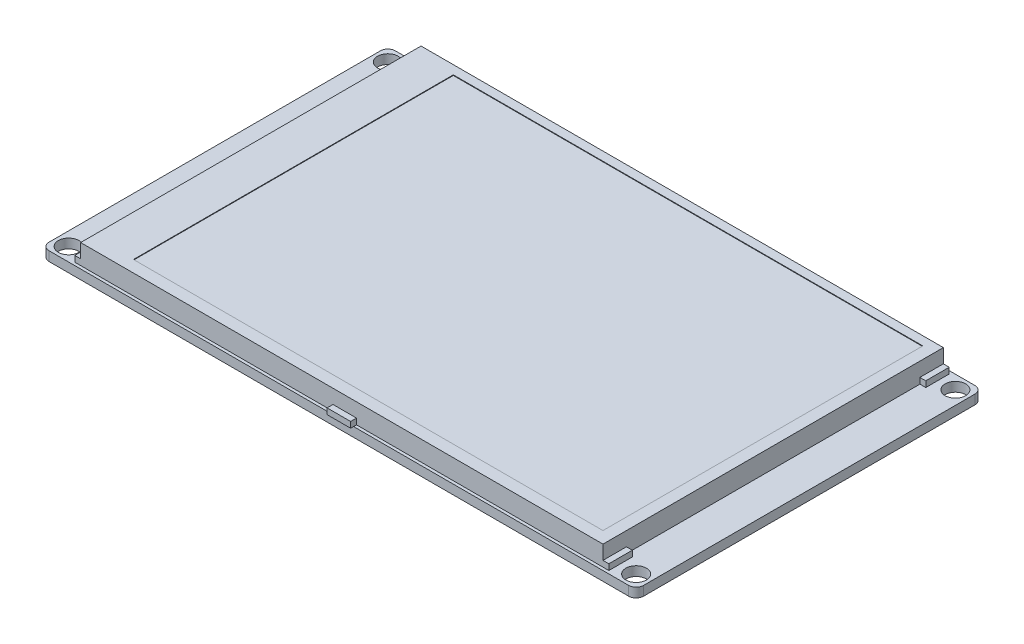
ISO-10303-21;
HEADER;
FILE_DESCRIPTION(('STEP AP214'),'2;1');
FILE_NAME('part.step','',(''),(''),'','','');
FILE_SCHEMA(('AUTOMOTIVE_DESIGN { 1 0 10303 214 1 1 1 1 }'));
ENDSEC;
DATA;
#1=APPLICATION_CONTEXT('core data for automotive mechanical design processes');
#2=APPLICATION_PROTOCOL_DEFINITION('international standard','automotive_design',2000,#1);
#3=PRODUCT_CONTEXT('',#1,'mechanical');
#4=PRODUCT('Part','Part','',(#3));
#5=PRODUCT_RELATED_PRODUCT_CATEGORY('part','',(#4));
#6=PRODUCT_DEFINITION_FORMATION('','',#4);
#7=PRODUCT_DEFINITION_CONTEXT('part definition',#1,'design');
#8=PRODUCT_DEFINITION('design','',#6,#7);
#9=PRODUCT_DEFINITION_SHAPE('','',#8);
#10=(LENGTH_UNIT() NAMED_UNIT(*) SI_UNIT(.MILLI.,.METRE.));
#11=(NAMED_UNIT(*) PLANE_ANGLE_UNIT() SI_UNIT($,.RADIAN.));
#12=(NAMED_UNIT(*) SI_UNIT($,.STERADIAN.) SOLID_ANGLE_UNIT());
#13=UNCERTAINTY_MEASURE_WITH_UNIT(LENGTH_MEASURE(1.E-05),#10,'distance_accuracy_value','');
#14=(GEOMETRIC_REPRESENTATION_CONTEXT(3) GLOBAL_UNCERTAINTY_ASSIGNED_CONTEXT((#13)) GLOBAL_UNIT_ASSIGNED_CONTEXT((#10,
#11,#12)) REPRESENTATION_CONTEXT('',''));
#15=CARTESIAN_POINT('',(0.,0.,0.));
#16=DIRECTION('',(0.,0.,1.));
#17=DIRECTION('',(1.,0.,0.));
#18=AXIS2_PLACEMENT_3D('',#15,#16,#17);
#19=CARTESIAN_POINT('',(0.,1.6,0.));
#20=DIRECTION('',(0.,1.,0.));
#21=DIRECTION('',(0.,0.,1.));
#22=AXIS2_PLACEMENT_3D('',#19,#20,#21);
#23=PLANE('',#22);
#24=CARTESIAN_POINT('',(-48.35,1.6,-27.2));
#25=DIRECTION('',(0.,1.,0.));
#26=DIRECTION('',(0.,0.,1.));
#27=AXIS2_PLACEMENT_3D('',#24,#25,#26);
#28=CIRCLE('',#27,1.75);
#29=CARTESIAN_POINT('',(-48.35,1.6,-25.45));
#30=VERTEX_POINT('',#29);
#31=EDGE_CURVE('E551',#30,#30,#28,.F.);
#32=ORIENTED_EDGE('',*,*,#31,.T.);
#33=EDGE_LOOP('',(#32));
#34=FACE_BOUND('',#33,.T.);
#35=CARTESIAN_POINT('',(-48.35,1.6,27.2));
#36=DIRECTION('',(0.,1.,0.));
#37=DIRECTION('',(0.,0.,1.));
#38=AXIS2_PLACEMENT_3D('',#35,#36,#37);
#39=CIRCLE('',#38,1.75);
#40=CARTESIAN_POINT('',(-48.35,1.6,28.95));
#41=VERTEX_POINT('',#40);
#42=EDGE_CURVE('E548',#41,#41,#39,.T.);
#43=ORIENTED_EDGE('',*,*,#42,.F.);
#44=EDGE_LOOP('',(#43));
#45=FACE_BOUND('',#44,.T.);
#46=DIRECTION('',(1.,0.,0.));
#47=VECTOR('',#46,1.);
#48=CARTESIAN_POINT('',(0.,1.6,29.5));
#49=LINE('',#48,#47);
#50=CARTESIAN_POINT('',(-49.38,1.6,29.5));
#51=VERTEX_POINT('',#50);
#52=CARTESIAN_POINT('',(-1.50000000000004,1.6,29.5));
#53=VERTEX_POINT('',#52);
#54=EDGE_CURVE('E534',#51,#53,#49,.T.);
#55=ORIENTED_EDGE('',*,*,#54,.T.);
#56=DIRECTION('',(0.,0.,1.));
#57=VECTOR('',#56,1.);
#58=CARTESIAN_POINT('',(-1.50000000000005,1.6,0.));
#59=LINE('',#58,#57);
#60=CARTESIAN_POINT('',(-1.50000000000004,1.6,29.));
#61=VERTEX_POINT('',#60);
#62=EDGE_CURVE('E337',#61,#53,#59,.T.);
#63=ORIENTED_EDGE('',*,*,#62,.F.);
#64=DIRECTION('',(-1.,0.,0.));
#65=VECTOR('',#64,1.);
#66=CARTESIAN_POINT('',(0.,1.6,29.));
#67=LINE('',#66,#65);
#68=CARTESIAN_POINT('',(-45.5,1.6,29.));
#69=VERTEX_POINT('',#68);
#70=EDGE_CURVE('E505',#61,#69,#67,.T.);
#71=ORIENTED_EDGE('',*,*,#70,.T.);
#72=DIRECTION('',(0.,0.,-1.));
#73=VECTOR('',#72,1.);
#74=CARTESIAN_POINT('',(-45.5,1.6,0.));
#75=LINE('',#74,#73);
#76=CARTESIAN_POINT('',(-45.5,1.6,25.));
#77=VERTEX_POINT('',#76);
#78=EDGE_CURVE('E440',#69,#77,#75,.T.);
#79=ORIENTED_EDGE('',*,*,#78,.T.);
#80=DIRECTION('',(-1.,0.,0.));
#81=VECTOR('',#80,1.);
#82=CARTESIAN_POINT('',(0.,1.6,25.));
#83=LINE('',#82,#81);
#84=CARTESIAN_POINT('',(-44.5,1.6,25.));
#85=VERTEX_POINT('',#84);
#86=EDGE_CURVE('E435',#85,#77,#83,.T.);
#87=ORIENTED_EDGE('',*,*,#86,.F.);
#88=DIRECTION('',(0.,0.,-1.));
#89=VECTOR('',#88,1.);
#90=CARTESIAN_POINT('',(-44.5,1.6,0.));
#91=LINE('',#90,#89);
#92=CARTESIAN_POINT('',(-44.5,1.6,-25.));
#93=VERTEX_POINT('',#92);
#94=EDGE_CURVE('E509',#85,#93,#91,.T.);
#95=ORIENTED_EDGE('',*,*,#94,.T.);
#96=DIRECTION('',(-1.,0.,0.));
#97=VECTOR('',#96,1.);
#98=CARTESIAN_POINT('',(0.,1.6,-25.));
#99=LINE('',#98,#97);
#100=CARTESIAN_POINT('',(-45.5,1.6,-25.));
#101=VERTEX_POINT('',#100);
#102=EDGE_CURVE('E464',#93,#101,#99,.T.);
#103=ORIENTED_EDGE('',*,*,#102,.T.);
#104=DIRECTION('',(0.,0.,1.));
#105=VECTOR('',#104,1.);
#106=CARTESIAN_POINT('',(-45.5,1.6,0.));
#107=LINE('',#106,#105);
#108=CARTESIAN_POINT('',(-45.5,1.6,-29.));
#109=VERTEX_POINT('',#108);
#110=EDGE_CURVE('E459',#109,#101,#107,.T.);
#111=ORIENTED_EDGE('',*,*,#110,.F.);
#112=DIRECTION('',(-1.,0.,0.));
#113=VECTOR('',#112,1.);
#114=CARTESIAN_POINT('',(0.,1.6,-29.));
#115=LINE('',#114,#113);
#116=CARTESIAN_POINT('',(-1.50000000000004,1.6,-29.));
#117=VERTEX_POINT('',#116);
#118=EDGE_CURVE('E511',#117,#109,#115,.T.);
#119=ORIENTED_EDGE('',*,*,#118,.F.);
#120=DIRECTION('',(0.,0.,-1.));
#121=VECTOR('',#120,1.);
#122=CARTESIAN_POINT('',(-1.50000000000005,1.6,0.));
#123=LINE('',#122,#121);
#124=CARTESIAN_POINT('',(-1.50000000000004,1.6,-29.5));
#125=VERTEX_POINT('',#124);
#126=EDGE_CURVE('E359',#117,#125,#123,.T.);
#127=ORIENTED_EDGE('',*,*,#126,.T.);
#128=DIRECTION('',(1.,0.,0.));
#129=VECTOR('',#128,1.);
#130=CARTESIAN_POINT('',(0.,1.6,-29.5));
#131=LINE('',#130,#129);
#132=CARTESIAN_POINT('',(-49.38,1.6,-29.5));
#133=VERTEX_POINT('',#132);
#134=EDGE_CURVE('E524',#133,#125,#131,.T.);
#135=ORIENTED_EDGE('',*,*,#134,.F.);
#136=CARTESIAN_POINT('',(-49.38,1.6,-28.23));
#137=DIRECTION('',(0.,1.,0.));
#138=DIRECTION('',(0.,0.,1.));
#139=AXIS2_PLACEMENT_3D('',#136,#137,#138);
#140=CIRCLE('',#139,1.27);
#141=CARTESIAN_POINT('',(-50.65,1.6,-28.23));
#142=VERTEX_POINT('',#141);
#143=EDGE_CURVE('E527',#133,#142,#140,.T.);
#144=ORIENTED_EDGE('',*,*,#143,.T.);
#145=DIRECTION('',(0.,0.,1.));
#146=VECTOR('',#145,1.);
#147=CARTESIAN_POINT('',(-50.65,1.6,0.));
#148=LINE('',#147,#146);
#149=CARTESIAN_POINT('',(-50.65,1.6,28.23));
#150=VERTEX_POINT('',#149);
#151=EDGE_CURVE('E529',#142,#150,#148,.T.);
#152=ORIENTED_EDGE('',*,*,#151,.T.);
#153=CARTESIAN_POINT('',(-49.38,1.6,28.23));
#154=DIRECTION('',(0.,1.,0.));
#155=DIRECTION('',(0.,0.,1.));
#156=AXIS2_PLACEMENT_3D('',#153,#154,#155);
#157=CIRCLE('',#156,1.27);
#158=EDGE_CURVE('E531',#150,#51,#157,.T.);
#159=ORIENTED_EDGE('',*,*,#158,.T.);
#160=EDGE_LOOP('',(#55,#63,#71,#79,#87,#95,#103,#111,#119,#127,#135,#144,#152,#159));
#161=FACE_BOUND('',#160,.T.);
#162=ADVANCED_FACE('F39',(#34,#45,#161),#23,.T.);
#163=DIRECTION('',(0.,0.,1.));
#164=VECTOR('',#163,1.);
#165=CARTESIAN_POINT('',(2.49999999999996,1.6,0.));
#166=LINE('',#165,#164);
#167=CARTESIAN_POINT('',(2.49999999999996,1.6,29.));
#168=VERTEX_POINT('',#167);
#169=CARTESIAN_POINT('',(2.49999999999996,1.6,29.5));
#170=VERTEX_POINT('',#169);
#171=EDGE_CURVE('E333',#168,#170,#166,.T.);
#172=ORIENTED_EDGE('',*,*,#171,.T.);
#173=CARTESIAN_POINT('',(49.38,1.6,29.5));
#174=VERTEX_POINT('',#173);
#175=EDGE_CURVE('E533',#170,#174,#49,.T.);
#176=ORIENTED_EDGE('',*,*,#175,.T.);
#177=CARTESIAN_POINT('',(49.38,1.6,28.23));
#178=DIRECTION('',(0.,1.,0.));
#179=DIRECTION('',(0.,0.,1.));
#180=AXIS2_PLACEMENT_3D('',#177,#178,#179);
#181=CIRCLE('',#180,1.27);
#182=CARTESIAN_POINT('',(50.65,1.6,28.23));
#183=VERTEX_POINT('',#182);
#184=EDGE_CURVE('E537',#174,#183,#181,.T.);
#185=ORIENTED_EDGE('',*,*,#184,.T.);
#186=DIRECTION('',(0.,0.,1.));
#187=VECTOR('',#186,1.);
#188=CARTESIAN_POINT('',(50.65,1.6,0.));
#189=LINE('',#188,#187);
#190=CARTESIAN_POINT('',(50.65,1.6,-28.23));
#191=VERTEX_POINT('',#190);
#192=EDGE_CURVE('E539',#191,#183,#189,.T.);
#193=ORIENTED_EDGE('',*,*,#192,.F.);
#194=CARTESIAN_POINT('',(49.38,1.6,-28.23));
#195=DIRECTION('',(0.,1.,0.));
#196=DIRECTION('',(0.,0.,1.));
#197=AXIS2_PLACEMENT_3D('',#194,#195,#196);
#198=CIRCLE('',#197,1.27);
#199=CARTESIAN_POINT('',(49.38,1.6,-29.5));
#200=VERTEX_POINT('',#199);
#201=EDGE_CURVE('E519',#200,#191,#198,.F.);
#202=ORIENTED_EDGE('',*,*,#201,.F.);
#203=CARTESIAN_POINT('',(2.49999999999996,1.6,-29.5));
#204=VERTEX_POINT('',#203);
#205=EDGE_CURVE('E522',#204,#200,#131,.T.);
#206=ORIENTED_EDGE('',*,*,#205,.F.);
#207=DIRECTION('',(0.,0.,-1.));
#208=VECTOR('',#207,1.);
#209=CARTESIAN_POINT('',(2.49999999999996,1.6,0.));
#210=LINE('',#209,#208);
#211=CARTESIAN_POINT('',(2.49999999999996,1.6,-29.));
#212=VERTEX_POINT('',#211);
#213=EDGE_CURVE('E368',#212,#204,#210,.T.);
#214=ORIENTED_EDGE('',*,*,#213,.F.);
#215=CARTESIAN_POINT('',(45.5,1.6,-29.));
#216=VERTEX_POINT('',#215);
#217=EDGE_CURVE('E512',#216,#212,#115,.T.);
#218=ORIENTED_EDGE('',*,*,#217,.F.);
#219=DIRECTION('',(0.,0.,1.));
#220=VECTOR('',#219,1.);
#221=CARTESIAN_POINT('',(45.5,1.6,0.));
#222=LINE('',#221,#220);
#223=CARTESIAN_POINT('',(45.5,1.6,-25.));
#224=VERTEX_POINT('',#223);
#225=EDGE_CURVE('E394',#216,#224,#222,.T.);
#226=ORIENTED_EDGE('',*,*,#225,.T.);
#227=DIRECTION('',(1.,0.,0.));
#228=VECTOR('',#227,1.);
#229=CARTESIAN_POINT('',(0.,1.6,-25.));
#230=LINE('',#229,#228);
#231=CARTESIAN_POINT('',(44.5,1.6,-25.));
#232=VERTEX_POINT('',#231);
#233=EDGE_CURVE('E389',#232,#224,#230,.T.);
#234=ORIENTED_EDGE('',*,*,#233,.F.);
#235=DIRECTION('',(0.,0.,-1.));
#236=VECTOR('',#235,1.);
#237=CARTESIAN_POINT('',(44.5,1.6,0.));
#238=LINE('',#237,#236);
#239=CARTESIAN_POINT('',(44.5,1.6,25.));
#240=VERTEX_POINT('',#239);
#241=EDGE_CURVE('E515',#240,#232,#238,.T.);
#242=ORIENTED_EDGE('',*,*,#241,.F.);
#243=DIRECTION('',(1.,0.,0.));
#244=VECTOR('',#243,1.);
#245=CARTESIAN_POINT('',(0.,1.6,25.));
#246=LINE('',#245,#244);
#247=CARTESIAN_POINT('',(45.5,1.6,25.));
#248=VERTEX_POINT('',#247);
#249=EDGE_CURVE('E417',#240,#248,#246,.T.);
#250=ORIENTED_EDGE('',*,*,#249,.T.);
#251=DIRECTION('',(0.,0.,-1.));
#252=VECTOR('',#251,1.);
#253=CARTESIAN_POINT('',(45.5,1.6,0.));
#254=LINE('',#253,#252);
#255=CARTESIAN_POINT('',(45.5,1.6,29.));
#256=VERTEX_POINT('',#255);
#257=EDGE_CURVE('E412',#256,#248,#254,.T.);
#258=ORIENTED_EDGE('',*,*,#257,.F.);
#259=EDGE_CURVE('E506',#256,#168,#67,.T.);
#260=ORIENTED_EDGE('',*,*,#259,.T.);
#261=EDGE_LOOP('',(#172,#176,#185,#193,#202,#206,#214,#218,#226,#234,#242,#250,#258,#260));
#262=FACE_BOUND('',#261,.T.);
#263=CARTESIAN_POINT('',(48.35,1.6,-27.2));
#264=DIRECTION('',(0.,1.,0.));
#265=DIRECTION('',(0.,0.,1.));
#266=AXIS2_PLACEMENT_3D('',#263,#264,#265);
#267=CIRCLE('',#266,1.75);
#268=CARTESIAN_POINT('',(48.35,1.6,-25.45));
#269=VERTEX_POINT('',#268);
#270=EDGE_CURVE('E542',#269,#269,#267,.T.);
#271=ORIENTED_EDGE('',*,*,#270,.F.);
#272=EDGE_LOOP('',(#271));
#273=FACE_BOUND('',#272,.T.);
#274=CARTESIAN_POINT('',(48.35,1.6,27.2));
#275=DIRECTION('',(0.,1.,0.));
#276=DIRECTION('',(0.,0.,1.));
#277=AXIS2_PLACEMENT_3D('',#274,#275,#276);
#278=CIRCLE('',#277,1.75);
#279=CARTESIAN_POINT('',(48.35,1.6,28.95));
#280=VERTEX_POINT('',#279);
#281=EDGE_CURVE('E545',#280,#280,#278,.F.);
#282=ORIENTED_EDGE('',*,*,#281,.T.);
#283=EDGE_LOOP('',(#282));
#284=FACE_BOUND('',#283,.T.);
#285=ADVANCED_FACE('F662',(#262,#273,#284),#23,.T.);
#286=CARTESIAN_POINT('',(0.,5.,-29.));
#287=DIRECTION('',(0.,0.,-1.));
#288=DIRECTION('',(-1.,0.,0.));
#289=AXIS2_PLACEMENT_3D('',#286,#287,#288);
#290=PLANE('',#289);
#291=ORIENTED_EDGE('',*,*,#217,.T.);
#292=DIRECTION('',(0.,-1.,0.));
#293=VECTOR('',#292,1.);
#294=CARTESIAN_POINT('',(2.49999999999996,2.6,-29.));
#295=LINE('',#294,#293);
#296=CARTESIAN_POINT('',(2.49999999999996,2.6,-29.));
#297=VERTEX_POINT('',#296);
#298=EDGE_CURVE('E383',#297,#212,#295,.T.);
#299=ORIENTED_EDGE('',*,*,#298,.F.);
#300=DIRECTION('',(1.,0.,0.));
#301=VECTOR('',#300,1.);
#302=CARTESIAN_POINT('',(0.,2.6,-29.));
#303=LINE('',#302,#301);
#304=CARTESIAN_POINT('',(-1.50000000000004,2.6,-29.));
#305=VERTEX_POINT('',#304);
#306=EDGE_CURVE('E355',#305,#297,#303,.T.);
#307=ORIENTED_EDGE('',*,*,#306,.F.);
#308=DIRECTION('',(0.,-1.,0.));
#309=VECTOR('',#308,1.);
#310=CARTESIAN_POINT('',(-1.50000000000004,2.6,-29.));
#311=LINE('',#310,#309);
#312=EDGE_CURVE('E367',#305,#117,#311,.T.);
#313=ORIENTED_EDGE('',*,*,#312,.T.);
#314=ORIENTED_EDGE('',*,*,#118,.T.);
#315=DIRECTION('',(0.,-1.,0.));
#316=VECTOR('',#315,1.);
#317=CARTESIAN_POINT('',(-45.5,2.6,-29.));
#318=LINE('',#317,#316);
#319=CARTESIAN_POINT('',(-45.5,2.6,-29.));
#320=VERTEX_POINT('',#319);
#321=EDGE_CURVE('E481',#320,#109,#318,.T.);
#322=ORIENTED_EDGE('',*,*,#321,.F.);
#323=DIRECTION('',(-1.,0.,0.));
#324=VECTOR('',#323,1.);
#325=CARTESIAN_POINT('',(0.,2.6,-29.));
#326=LINE('',#325,#324);
#327=CARTESIAN_POINT('',(-44.5,2.6,-29.));
#328=VERTEX_POINT('',#327);
#329=EDGE_CURVE('E460',#328,#320,#326,.T.);
#330=ORIENTED_EDGE('',*,*,#329,.F.);
#331=DIRECTION('',(0.,-1.,0.));
#332=VECTOR('',#331,1.);
#333=CARTESIAN_POINT('',(-44.5,5.,-29.));
#334=LINE('',#333,#332);
#335=CARTESIAN_POINT('',(-44.5,5.,-29.));
#336=VERTEX_POINT('',#335);
#337=EDGE_CURVE('E499',#336,#328,#334,.T.);
#338=ORIENTED_EDGE('',*,*,#337,.F.);
#339=DIRECTION('',(1.,0.,0.));
#340=VECTOR('',#339,1.);
#341=CARTESIAN_POINT('',(0.,5.,-29.));
#342=LINE('',#341,#340);
#343=CARTESIAN_POINT('',(44.5,5.,-29.));
#344=VERTEX_POINT('',#343);
#345=EDGE_CURVE('E487',#336,#344,#342,.T.);
#346=ORIENTED_EDGE('',*,*,#345,.T.);
#347=DIRECTION('',(0.,-1.,0.));
#348=VECTOR('',#347,1.);
#349=CARTESIAN_POINT('',(44.5,5.,-29.));
#350=LINE('',#349,#348);
#351=CARTESIAN_POINT('',(44.5,2.6,-29.));
#352=VERTEX_POINT('',#351);
#353=EDGE_CURVE('E502',#344,#352,#350,.T.);
#354=ORIENTED_EDGE('',*,*,#353,.T.);
#355=DIRECTION('',(1.,0.,0.));
#356=VECTOR('',#355,1.);
#357=CARTESIAN_POINT('',(0.,2.6,-29.));
#358=LINE('',#357,#356);
#359=CARTESIAN_POINT('',(45.5,2.6,-29.));
#360=VERTEX_POINT('',#359);
#361=EDGE_CURVE('E390',#352,#360,#358,.T.);
#362=ORIENTED_EDGE('',*,*,#361,.T.);
#363=DIRECTION('',(0.,-1.,0.));
#364=VECTOR('',#363,1.);
#365=CARTESIAN_POINT('',(45.5,2.6,-29.));
#366=LINE('',#365,#364);
#367=EDGE_CURVE('E401',#360,#216,#366,.T.);
#368=ORIENTED_EDGE('',*,*,#367,.T.);
#369=EDGE_LOOP('',(#291,#299,#307,#313,#314,#322,#330,#338,#346,#354,#362,#368));
#370=FACE_BOUND('',#369,.T.);
#371=ADVANCED_FACE('F665',(#370),#290,.T.);
#372=CARTESIAN_POINT('',(44.5,5.,0.));
#373=DIRECTION('',(1.,0.,0.));
#374=DIRECTION('',(0.,0.,-1.));
#375=AXIS2_PLACEMENT_3D('',#372,#373,#374);
#376=PLANE('',#375);
#377=ORIENTED_EDGE('',*,*,#241,.T.);
#378=DIRECTION('',(0.,-1.,0.));
#379=VECTOR('',#378,1.);
#380=CARTESIAN_POINT('',(44.5,2.6,-25.));
#381=LINE('',#380,#379);
#382=CARTESIAN_POINT('',(44.5,2.6,-25.));
#383=VERTEX_POINT('',#382);
#384=EDGE_CURVE('E410',#383,#232,#381,.T.);
#385=ORIENTED_EDGE('',*,*,#384,.F.);
#386=DIRECTION('',(0.,0.,1.));
#387=VECTOR('',#386,1.);
#388=CARTESIAN_POINT('',(44.5,2.6,0.));
#389=LINE('',#388,#387);
#390=EDGE_CURVE('E393',#352,#383,#389,.T.);
#391=ORIENTED_EDGE('',*,*,#390,.F.);
#392=ORIENTED_EDGE('',*,*,#353,.F.);
#393=DIRECTION('',(0.,0.,1.));
#394=VECTOR('',#393,1.);
#395=CARTESIAN_POINT('',(44.5,5.,0.));
#396=LINE('',#395,#394);
#397=CARTESIAN_POINT('',(44.5,5.,29.));
#398=VERTEX_POINT('',#397);
#399=EDGE_CURVE('E484',#344,#398,#396,.T.);
#400=ORIENTED_EDGE('',*,*,#399,.T.);
#401=DIRECTION('',(0.,-1.,0.));
#402=VECTOR('',#401,1.);
#403=CARTESIAN_POINT('',(44.5,5.,29.));
#404=LINE('',#403,#402);
#405=CARTESIAN_POINT('',(44.5,2.6,29.));
#406=VERTEX_POINT('',#405);
#407=EDGE_CURVE('E494',#398,#406,#404,.T.);
#408=ORIENTED_EDGE('',*,*,#407,.T.);
#409=DIRECTION('',(0.,0.,1.));
#410=VECTOR('',#409,1.);
#411=CARTESIAN_POINT('',(44.5,2.6,0.));
#412=LINE('',#411,#410);
#413=CARTESIAN_POINT('',(44.5,2.6,25.));
#414=VERTEX_POINT('',#413);
#415=EDGE_CURVE('E413',#414,#406,#412,.T.);
#416=ORIENTED_EDGE('',*,*,#415,.F.);
#417=DIRECTION('',(0.,-1.,0.));
#418=VECTOR('',#417,1.);
#419=CARTESIAN_POINT('',(44.5,2.6,25.));
#420=LINE('',#419,#418);
#421=EDGE_CURVE('E424',#414,#240,#420,.T.);
#422=ORIENTED_EDGE('',*,*,#421,.T.);
#423=EDGE_LOOP('',(#377,#385,#391,#392,#400,#408,#416,#422));
#424=FACE_BOUND('',#423,.T.);
#425=ADVANCED_FACE('F677',(#424),#376,.T.);
#426=CARTESIAN_POINT('',(-44.5,5.,0.));
#427=DIRECTION('',(1.,0.,0.));
#428=DIRECTION('',(0.,0.,-1.));
#429=AXIS2_PLACEMENT_3D('',#426,#427,#428);
#430=PLANE('',#429);
#431=DIRECTION('',(0.,-1.,0.));
#432=VECTOR('',#431,1.);
#433=CARTESIAN_POINT('',(-44.5,2.6,25.));
#434=LINE('',#433,#432);
#435=CARTESIAN_POINT('',(-44.5,2.6,25.));
#436=VERTEX_POINT('',#435);
#437=EDGE_CURVE('E457',#436,#85,#434,.T.);
#438=ORIENTED_EDGE('',*,*,#437,.F.);
#439=DIRECTION('',(0.,0.,1.));
#440=VECTOR('',#439,1.);
#441=CARTESIAN_POINT('',(-44.5,2.6,0.));
#442=LINE('',#441,#440);
#443=CARTESIAN_POINT('',(-44.5,2.6,29.));
#444=VERTEX_POINT('',#443);
#445=EDGE_CURVE('E439',#436,#444,#442,.T.);
#446=ORIENTED_EDGE('',*,*,#445,.T.);
#447=DIRECTION('',(0.,-1.,0.));
#448=VECTOR('',#447,1.);
#449=CARTESIAN_POINT('',(-44.5,5.,29.));
#450=LINE('',#449,#448);
#451=CARTESIAN_POINT('',(-44.5,5.,29.));
#452=VERTEX_POINT('',#451);
#453=EDGE_CURVE('E496',#452,#444,#450,.T.);
#454=ORIENTED_EDGE('',*,*,#453,.F.);
#455=DIRECTION('',(0.,0.,1.));
#456=VECTOR('',#455,1.);
#457=CARTESIAN_POINT('',(-44.5,5.,0.));
#458=LINE('',#457,#456);
#459=EDGE_CURVE('E490',#336,#452,#458,.T.);
#460=ORIENTED_EDGE('',*,*,#459,.F.);
#461=ORIENTED_EDGE('',*,*,#337,.T.);
#462=DIRECTION('',(0.,0.,1.));
#463=VECTOR('',#462,1.);
#464=CARTESIAN_POINT('',(-44.5,2.6,0.));
#465=LINE('',#464,#463);
#466=CARTESIAN_POINT('',(-44.5,2.6,-25.));
#467=VERTEX_POINT('',#466);
#468=EDGE_CURVE('E469',#328,#467,#465,.T.);
#469=ORIENTED_EDGE('',*,*,#468,.T.);
#470=DIRECTION('',(0.,-1.,0.));
#471=VECTOR('',#470,1.);
#472=CARTESIAN_POINT('',(-44.5,2.6,-25.));
#473=LINE('',#472,#471);
#474=EDGE_CURVE('E472',#467,#93,#473,.T.);
#475=ORIENTED_EDGE('',*,*,#474,.T.);
#476=ORIENTED_EDGE('',*,*,#94,.F.);
#477=EDGE_LOOP('',(#438,#446,#454,#460,#461,#469,#475,#476));
#478=FACE_BOUND('',#477,.T.);
#479=ADVANCED_FACE('F716',(#478),#430,.F.);
#480=CARTESIAN_POINT('',(49.38,1.6,-28.23));
#481=DIRECTION('',(0.,-1.,0.));
#482=DIRECTION('',(0.,0.,-1.));
#483=AXIS2_PLACEMENT_3D('',#480,#481,#482);
#484=CYLINDRICAL_SURFACE('',#483,1.27);
#485=CARTESIAN_POINT('',(49.38,0.,-28.23));
#486=DIRECTION('',(0.,1.,0.));
#487=DIRECTION('',(0.,0.,1.));
#488=AXIS2_PLACEMENT_3D('',#485,#486,#487);
#489=CIRCLE('',#488,1.27);
#490=CARTESIAN_POINT('',(49.38,0.,-29.5));
#491=VERTEX_POINT('',#490);
#492=CARTESIAN_POINT('',(50.65,0.,-28.23));
#493=VERTEX_POINT('',#492);
#494=EDGE_CURVE('E518',#491,#493,#489,.F.);
#495=ORIENTED_EDGE('',*,*,#494,.F.);
#496=DIRECTION('',(0.,-1.,0.));
#497=VECTOR('',#496,1.);
#498=CARTESIAN_POINT('',(49.38,1.6,-29.5));
#499=LINE('',#498,#497);
#500=EDGE_CURVE('E11',#200,#491,#499,.T.);
#501=ORIENTED_EDGE('',*,*,#500,.F.);
#502=ORIENTED_EDGE('',*,*,#201,.T.);
#503=DIRECTION('',(0.,-1.,0.));
#504=VECTOR('',#503,1.);
#505=CARTESIAN_POINT('',(50.65,1.6,-28.23));
#506=LINE('',#505,#504);
#507=EDGE_CURVE('E554',#191,#493,#506,.T.);
#508=ORIENTED_EDGE('',*,*,#507,.T.);
#509=EDGE_LOOP('',(#495,#501,#502,#508));
#510=FACE_BOUND('',#509,.T.);
#511=ADVANCED_FACE('F41',(#510),#484,.T.);
#512=CARTESIAN_POINT('',(0.,1.6,-29.5));
#513=DIRECTION('',(0.,0.,-1.));
#514=DIRECTION('',(-1.,0.,0.));
#515=AXIS2_PLACEMENT_3D('',#512,#513,#514);
#516=PLANE('',#515);
#517=DIRECTION('',(1.,0.,0.));
#518=VECTOR('',#517,1.);
#519=CARTESIAN_POINT('',(0.,0.,-29.5));
#520=LINE('',#519,#518);
#521=CARTESIAN_POINT('',(-49.38,0.,-29.5));
#522=VERTEX_POINT('',#521);
#523=EDGE_CURVE('E557',#522,#491,#520,.T.);
#524=ORIENTED_EDGE('',*,*,#523,.F.);
#525=DIRECTION('',(0.,-1.,0.));
#526=VECTOR('',#525,1.);
#527=CARTESIAN_POINT('',(-49.38,1.6,-29.5));
#528=LINE('',#527,#526);
#529=EDGE_CURVE('E47',#133,#522,#528,.T.);
#530=ORIENTED_EDGE('',*,*,#529,.F.);
#531=ORIENTED_EDGE('',*,*,#134,.T.);
#532=DIRECTION('',(1.,0.,0.));
#533=VECTOR('',#532,1.);
#534=CARTESIAN_POINT('',(0.,1.6,-29.5));
#535=LINE('',#534,#533);
#536=EDGE_CURVE('E386',#125,#204,#535,.T.);
#537=ORIENTED_EDGE('',*,*,#536,.T.);
#538=ORIENTED_EDGE('',*,*,#205,.T.);
#539=ORIENTED_EDGE('',*,*,#500,.T.);
#540=EDGE_LOOP('',(#524,#530,#531,#537,#538,#539));
#541=FACE_BOUND('',#540,.T.);
#542=ADVANCED_FACE('F612',(#541),#516,.T.);
#543=CARTESIAN_POINT('',(-49.38,1.6,-28.23));
#544=DIRECTION('',(0.,-1.,0.));
#545=DIRECTION('',(0.,0.,-1.));
#546=AXIS2_PLACEMENT_3D('',#543,#544,#545);
#547=CYLINDRICAL_SURFACE('',#546,1.27);
#548=CARTESIAN_POINT('',(-49.38,0.,-28.23));
#549=DIRECTION('',(0.,1.,0.));
#550=DIRECTION('',(0.,0.,1.));
#551=AXIS2_PLACEMENT_3D('',#548,#549,#550);
#552=CIRCLE('',#551,1.27);
#553=CARTESIAN_POINT('',(-50.65,0.,-28.23));
#554=VERTEX_POINT('',#553);
#555=EDGE_CURVE('E560',#522,#554,#552,.T.);
#556=ORIENTED_EDGE('',*,*,#555,.T.);
#557=DIRECTION('',(0.,-1.,0.));
#558=VECTOR('',#557,1.);
#559=CARTESIAN_POINT('',(-50.65,1.6,-28.23));
#560=LINE('',#559,#558);
#561=EDGE_CURVE('E597',#142,#554,#560,.T.);
#562=ORIENTED_EDGE('',*,*,#561,.F.);
#563=ORIENTED_EDGE('',*,*,#143,.F.);
#564=ORIENTED_EDGE('',*,*,#529,.T.);
#565=EDGE_LOOP('',(#556,#562,#563,#564));
#566=FACE_BOUND('',#565,.T.);
#567=ADVANCED_FACE('F602',(#566),#547,.T.);
#568=CARTESIAN_POINT('',(-50.65,1.6,0.));
#569=DIRECTION('',(1.,0.,0.));
#570=DIRECTION('',(0.,0.,-1.));
#571=AXIS2_PLACEMENT_3D('',#568,#569,#570);
#572=PLANE('',#571);
#573=DIRECTION('',(0.,0.,1.));
#574=VECTOR('',#573,1.);
#575=CARTESIAN_POINT('',(-50.65,0.,0.));
#576=LINE('',#575,#574);
#577=CARTESIAN_POINT('',(-50.65,0.,28.23));
#578=VERTEX_POINT('',#577);
#579=EDGE_CURVE('E562',#554,#578,#576,.T.);
#580=ORIENTED_EDGE('',*,*,#579,.T.);
#581=DIRECTION('',(0.,-1.,0.));
#582=VECTOR('',#581,1.);
#583=CARTESIAN_POINT('',(-50.65,1.6,28.23));
#584=LINE('',#583,#582);
#585=EDGE_CURVE('E594',#150,#578,#584,.T.);
#586=ORIENTED_EDGE('',*,*,#585,.F.);
#587=ORIENTED_EDGE('',*,*,#151,.F.);
#588=ORIENTED_EDGE('',*,*,#561,.T.);
#589=EDGE_LOOP('',(#580,#586,#587,#588));
#590=FACE_BOUND('',#589,.T.);
#591=ADVANCED_FACE('F640',(#590),#572,.F.);
#592=CARTESIAN_POINT('',(-49.38,1.6,28.23));
#593=DIRECTION('',(0.,-1.,0.));
#594=DIRECTION('',(0.,0.,-1.));
#595=AXIS2_PLACEMENT_3D('',#592,#593,#594);
#596=CYLINDRICAL_SURFACE('',#595,1.27);
#597=CARTESIAN_POINT('',(-49.38,0.,28.23));
#598=DIRECTION('',(0.,1.,0.));
#599=DIRECTION('',(0.,0.,1.));
#600=AXIS2_PLACEMENT_3D('',#597,#598,#599);
#601=CIRCLE('',#600,1.27);
#602=CARTESIAN_POINT('',(-49.38,0.,29.5));
#603=VERTEX_POINT('',#602);
#604=EDGE_CURVE('E564',#578,#603,#601,.T.);
#605=ORIENTED_EDGE('',*,*,#604,.T.);
#606=DIRECTION('',(0.,-1.,0.));
#607=VECTOR('',#606,1.);
#608=CARTESIAN_POINT('',(-49.38,1.6,29.5));
#609=LINE('',#608,#607);
#610=EDGE_CURVE('E591',#51,#603,#609,.T.);
#611=ORIENTED_EDGE('',*,*,#610,.F.);
#612=ORIENTED_EDGE('',*,*,#158,.F.);
#613=ORIENTED_EDGE('',*,*,#585,.T.);
#614=EDGE_LOOP('',(#605,#611,#612,#613));
#615=FACE_BOUND('',#614,.T.);
#616=ADVANCED_FACE('F636',(#615),#596,.T.);
#617=CARTESIAN_POINT('',(0.,1.6,29.5));
#618=DIRECTION('',(0.,0.,-1.));
#619=DIRECTION('',(-1.,0.,0.));
#620=AXIS2_PLACEMENT_3D('',#617,#618,#619);
#621=PLANE('',#620);
#622=DIRECTION('',(1.,0.,0.));
#623=VECTOR('',#622,1.);
#624=CARTESIAN_POINT('',(0.,0.,29.5));
#625=LINE('',#624,#623);
#626=CARTESIAN_POINT('',(49.38,0.,29.5));
#627=VERTEX_POINT('',#626);
#628=EDGE_CURVE('E566',#603,#627,#625,.T.);
#629=ORIENTED_EDGE('',*,*,#628,.T.);
#630=DIRECTION('',(0.,-1.,0.));
#631=VECTOR('',#630,1.);
#632=CARTESIAN_POINT('',(49.38,1.6,29.5));
#633=LINE('',#632,#631);
#634=EDGE_CURVE('E588',#174,#627,#633,.T.);
#635=ORIENTED_EDGE('',*,*,#634,.F.);
#636=ORIENTED_EDGE('',*,*,#175,.F.);
#637=DIRECTION('',(1.,0.,0.));
#638=VECTOR('',#637,1.);
#639=CARTESIAN_POINT('',(0.,1.6,29.5));
#640=LINE('',#639,#638);
#641=EDGE_CURVE('E352',#53,#170,#640,.T.);
#642=ORIENTED_EDGE('',*,*,#641,.F.);
#643=ORIENTED_EDGE('',*,*,#54,.F.);
#644=ORIENTED_EDGE('',*,*,#610,.T.);
#645=EDGE_LOOP('',(#629,#635,#636,#642,#643,#644));
#646=FACE_BOUND('',#645,.T.);
#647=ADVANCED_FACE('F629',(#646),#621,.F.);
#648=CARTESIAN_POINT('',(49.38,1.6,28.23));
#649=DIRECTION('',(0.,-1.,0.));
#650=DIRECTION('',(0.,0.,-1.));
#651=AXIS2_PLACEMENT_3D('',#648,#649,#650);
#652=CYLINDRICAL_SURFACE('',#651,1.27);
#653=CARTESIAN_POINT('',(49.38,0.,28.23));
#654=DIRECTION('',(0.,1.,0.));
#655=DIRECTION('',(0.,0.,1.));
#656=AXIS2_PLACEMENT_3D('',#653,#654,#655);
#657=CIRCLE('',#656,1.27);
#658=CARTESIAN_POINT('',(50.65,0.,28.23));
#659=VERTEX_POINT('',#658);
#660=EDGE_CURVE('E568',#627,#659,#657,.T.);
#661=ORIENTED_EDGE('',*,*,#660,.T.);
#662=DIRECTION('',(0.,-1.,0.));
#663=VECTOR('',#662,1.);
#664=CARTESIAN_POINT('',(50.65,1.6,28.23));
#665=LINE('',#664,#663);
#666=EDGE_CURVE('E586',#183,#659,#665,.T.);
#667=ORIENTED_EDGE('',*,*,#666,.F.);
#668=ORIENTED_EDGE('',*,*,#184,.F.);
#669=ORIENTED_EDGE('',*,*,#634,.T.);
#670=EDGE_LOOP('',(#661,#667,#668,#669));
#671=FACE_BOUND('',#670,.T.);
#672=ADVANCED_FACE('F625',(#671),#652,.T.);
#673=CARTESIAN_POINT('',(-48.35,1.6,27.2));
#674=DIRECTION('',(0.,-1.,0.));
#675=DIRECTION('',(0.,0.,-1.));
#676=AXIS2_PLACEMENT_3D('',#673,#674,#675);
#677=CYLINDRICAL_SURFACE('',#676,1.75);
#678=ORIENTED_EDGE('',*,*,#42,.T.);
#679=EDGE_LOOP('',(#678));
#680=FACE_BOUND('',#679,.T.);
#681=CARTESIAN_POINT('',(-48.35,0.,27.2));
#682=DIRECTION('',(0.,1.,0.));
#683=DIRECTION('',(0.,0.,1.));
#684=AXIS2_PLACEMENT_3D('',#681,#682,#683);
#685=CIRCLE('',#684,1.75);
#686=CARTESIAN_POINT('',(-48.35,0.,28.95));
#687=VERTEX_POINT('',#686);
#688=EDGE_CURVE('E580',#687,#687,#685,.T.);
#689=ORIENTED_EDGE('',*,*,#688,.F.);
#690=EDGE_LOOP('',(#689));
#691=FACE_BOUND('',#690,.T.);
#692=ADVANCED_FACE('F753',(#680,#691),#677,.F.);
#693=CARTESIAN_POINT('',(48.35,1.6,27.2));
#694=DIRECTION('',(0.,-1.,0.));
#695=DIRECTION('',(0.,0.,-1.));
#696=AXIS2_PLACEMENT_3D('',#693,#694,#695);
#697=CYLINDRICAL_SURFACE('',#696,1.75);
#698=ORIENTED_EDGE('',*,*,#281,.F.);
#699=EDGE_LOOP('',(#698));
#700=FACE_BOUND('',#699,.T.);
#701=CARTESIAN_POINT('',(48.35,0.,27.2));
#702=DIRECTION('',(0.,1.,0.));
#703=DIRECTION('',(0.,0.,1.));
#704=AXIS2_PLACEMENT_3D('',#701,#702,#703);
#705=CIRCLE('',#704,1.75);
#706=CARTESIAN_POINT('',(48.35,0.,28.95));
#707=VERTEX_POINT('',#706);
#708=EDGE_CURVE('E577',#707,#707,#705,.F.);
#709=ORIENTED_EDGE('',*,*,#708,.T.);
#710=EDGE_LOOP('',(#709));
#711=FACE_BOUND('',#710,.T.);
#712=ADVANCED_FACE('F756',(#700,#711),#697,.F.);
#713=CARTESIAN_POINT('',(48.35,1.6,-27.2));
#714=DIRECTION('',(0.,-1.,0.));
#715=DIRECTION('',(0.,0.,-1.));
#716=AXIS2_PLACEMENT_3D('',#713,#714,#715);
#717=CYLINDRICAL_SURFACE('',#716,1.75);
#718=ORIENTED_EDGE('',*,*,#270,.T.);
#719=EDGE_LOOP('',(#718));
#720=FACE_BOUND('',#719,.T.);
#721=CARTESIAN_POINT('',(48.35,0.,-27.2));
#722=DIRECTION('',(0.,1.,0.));
#723=DIRECTION('',(0.,0.,1.));
#724=AXIS2_PLACEMENT_3D('',#721,#722,#723);
#725=CIRCLE('',#724,1.75);
#726=CARTESIAN_POINT('',(48.35,0.,-25.45));
#727=VERTEX_POINT('',#726);
#728=EDGE_CURVE('E574',#727,#727,#725,.T.);
#729=ORIENTED_EDGE('',*,*,#728,.F.);
#730=EDGE_LOOP('',(#729));
#731=FACE_BOUND('',#730,.T.);
#732=ADVANCED_FACE('F760',(#720,#731),#717,.F.);
#733=CARTESIAN_POINT('',(50.65,1.6,0.));
#734=DIRECTION('',(1.,0.,0.));
#735=DIRECTION('',(0.,0.,-1.));
#736=AXIS2_PLACEMENT_3D('',#733,#734,#735);
#737=PLANE('',#736);
#738=DIRECTION('',(0.,0.,1.));
#739=VECTOR('',#738,1.);
#740=CARTESIAN_POINT('',(50.65,0.,0.));
#741=LINE('',#740,#739);
#742=EDGE_CURVE('E571',#493,#659,#741,.T.);
#743=ORIENTED_EDGE('',*,*,#742,.F.);
#744=ORIENTED_EDGE('',*,*,#507,.F.);
#745=ORIENTED_EDGE('',*,*,#192,.T.);
#746=ORIENTED_EDGE('',*,*,#666,.T.);
#747=EDGE_LOOP('',(#743,#744,#745,#746));
#748=FACE_BOUND('',#747,.T.);
#749=ADVANCED_FACE('F620',(#748),#737,.T.);
#750=CARTESIAN_POINT('',(-48.35,1.6,-27.2));
#751=DIRECTION('',(0.,-1.,0.));
#752=DIRECTION('',(0.,0.,-1.));
#753=AXIS2_PLACEMENT_3D('',#750,#751,#752);
#754=CYLINDRICAL_SURFACE('',#753,1.75);
#755=ORIENTED_EDGE('',*,*,#31,.F.);
#756=EDGE_LOOP('',(#755));
#757=FACE_BOUND('',#756,.T.);
#758=CARTESIAN_POINT('',(-48.35,0.,-27.2));
#759=DIRECTION('',(0.,1.,0.));
#760=DIRECTION('',(0.,0.,1.));
#761=AXIS2_PLACEMENT_3D('',#758,#759,#760);
#762=CIRCLE('',#761,1.75);
#763=CARTESIAN_POINT('',(-48.35,0.,-25.45));
#764=VERTEX_POINT('',#763);
#765=EDGE_CURVE('E523',#764,#764,#762,.F.);
#766=ORIENTED_EDGE('',*,*,#765,.T.);
#767=EDGE_LOOP('',(#766));
#768=FACE_BOUND('',#767,.T.);
#769=ADVANCED_FACE('F749',(#757,#768),#754,.F.);
#770=CARTESIAN_POINT('',(0.,0.,0.));
#771=DIRECTION('',(0.,1.,0.));
#772=DIRECTION('',(0.,0.,1.));
#773=AXIS2_PLACEMENT_3D('',#770,#771,#772);
#774=PLANE('',#773);
#775=ORIENTED_EDGE('',*,*,#494,.T.);
#776=ORIENTED_EDGE('',*,*,#742,.T.);
#777=ORIENTED_EDGE('',*,*,#660,.F.);
#778=ORIENTED_EDGE('',*,*,#628,.F.);
#779=ORIENTED_EDGE('',*,*,#604,.F.);
#780=ORIENTED_EDGE('',*,*,#579,.F.);
#781=ORIENTED_EDGE('',*,*,#555,.F.);
#782=ORIENTED_EDGE('',*,*,#523,.T.);
#783=EDGE_LOOP('',(#775,#776,#777,#778,#779,#780,#781,#782));
#784=FACE_BOUND('',#783,.T.);
#785=ORIENTED_EDGE('',*,*,#728,.T.);
#786=EDGE_LOOP('',(#785));
#787=FACE_BOUND('',#786,.T.);
#788=ORIENTED_EDGE('',*,*,#708,.F.);
#789=EDGE_LOOP('',(#788));
#790=FACE_BOUND('',#789,.T.);
#791=ORIENTED_EDGE('',*,*,#688,.T.);
#792=EDGE_LOOP('',(#791));
#793=FACE_BOUND('',#792,.T.);
#794=ORIENTED_EDGE('',*,*,#765,.F.);
#795=EDGE_LOOP('',(#794));
#796=FACE_BOUND('',#795,.T.);
#797=ADVANCED_FACE('F609',(#784,#787,#790,#793,#796),#774,.F.);
#798=CARTESIAN_POINT('',(0.,5.,29.));
#799=DIRECTION('',(0.,0.,-1.));
#800=DIRECTION('',(-1.,0.,0.));
#801=AXIS2_PLACEMENT_3D('',#798,#799,#800);
#802=PLANE('',#801);
#803=DIRECTION('',(1.,0.,0.));
#804=VECTOR('',#803,1.);
#805=CARTESIAN_POINT('',(0.,2.6,29.));
#806=LINE('',#805,#804);
#807=CARTESIAN_POINT('',(-1.50000000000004,2.6,29.));
#808=VERTEX_POINT('',#807);
#809=CARTESIAN_POINT('',(2.49999999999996,2.6,29.));
#810=VERTEX_POINT('',#809);
#811=EDGE_CURVE('E324',#808,#810,#806,.T.);
#812=ORIENTED_EDGE('',*,*,#811,.T.);
#813=DIRECTION('',(0.,-1.,0.));
#814=VECTOR('',#813,1.);
#815=CARTESIAN_POINT('',(2.49999999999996,2.6,29.));
#816=LINE('',#815,#814);
#817=EDGE_CURVE('E349',#810,#168,#816,.T.);
#818=ORIENTED_EDGE('',*,*,#817,.T.);
#819=ORIENTED_EDGE('',*,*,#259,.F.);
#820=DIRECTION('',(0.,-1.,0.));
#821=VECTOR('',#820,1.);
#822=CARTESIAN_POINT('',(45.5,2.6,29.));
#823=LINE('',#822,#821);
#824=CARTESIAN_POINT('',(45.5,2.6,29.));
#825=VERTEX_POINT('',#824);
#826=EDGE_CURVE('E432',#825,#256,#823,.T.);
#827=ORIENTED_EDGE('',*,*,#826,.F.);
#828=DIRECTION('',(1.,0.,0.));
#829=VECTOR('',#828,1.);
#830=CARTESIAN_POINT('',(4.02455846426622E-13,2.6,29.0000000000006));
#831=LINE('',#830,#829);
#832=EDGE_CURVE('E416',#406,#825,#831,.T.);
#833=ORIENTED_EDGE('',*,*,#832,.F.);
#834=ORIENTED_EDGE('',*,*,#407,.F.);
#835=DIRECTION('',(1.,0.,0.));
#836=VECTOR('',#835,1.);
#837=CARTESIAN_POINT('',(0.,5.,29.));
#838=LINE('',#837,#836);
#839=EDGE_CURVE('E492',#452,#398,#838,.T.);
#840=ORIENTED_EDGE('',*,*,#839,.F.);
#841=ORIENTED_EDGE('',*,*,#453,.T.);
#842=DIRECTION('',(-1.,0.,0.));
#843=VECTOR('',#842,1.);
#844=CARTESIAN_POINT('',(-4.02455846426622E-13,2.6,29.0000000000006));
#845=LINE('',#844,#843);
#846=CARTESIAN_POINT('',(-45.5,2.6,29.));
#847=VERTEX_POINT('',#846);
#848=EDGE_CURVE('E436',#444,#847,#845,.T.);
#849=ORIENTED_EDGE('',*,*,#848,.T.);
#850=DIRECTION('',(0.,-1.,0.));
#851=VECTOR('',#850,1.);
#852=CARTESIAN_POINT('',(-45.5,2.6,29.));
#853=LINE('',#852,#851);
#854=EDGE_CURVE('E448',#847,#69,#853,.T.);
#855=ORIENTED_EDGE('',*,*,#854,.T.);
#856=ORIENTED_EDGE('',*,*,#70,.F.);
#857=DIRECTION('',(0.,-1.,0.));
#858=VECTOR('',#857,1.);
#859=CARTESIAN_POINT('',(-1.50000000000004,2.6,29.));
#860=LINE('',#859,#858);
#861=EDGE_CURVE('E347',#808,#61,#860,.T.);
#862=ORIENTED_EDGE('',*,*,#861,.F.);
#863=EDGE_LOOP('',(#812,#818,#819,#827,#833,#834,#840,#841,#849,#855,#856,#862));
#864=FACE_BOUND('',#863,.T.);
#865=ADVANCED_FACE('F693',(#864),#802,.F.);
#866=CARTESIAN_POINT('',(0.,5.,0.));
#867=DIRECTION('',(0.,1.,0.));
#868=DIRECTION('',(0.,0.,1.));
#869=AXIS2_PLACEMENT_3D('',#866,#867,#868);
#870=PLANE('',#869);
#871=DIRECTION('',(0.,0.,1.));
#872=VECTOR('',#871,1.);
#873=CARTESIAN_POINT('',(-37.5,5.,0.));
#874=LINE('',#873,#872);
#875=CARTESIAN_POINT('',(-37.5,5.,-27.5));
#876=VERTEX_POINT('',#875);
#877=CARTESIAN_POINT('',(-37.5,5.,27.));
#878=VERTEX_POINT('',#877);
#879=EDGE_CURVE('E54',#876,#878,#874,.T.);
#880=ORIENTED_EDGE('',*,*,#879,.F.);
#881=DIRECTION('',(-1.,0.,0.));
#882=VECTOR('',#881,1.);
#883=CARTESIAN_POINT('',(0.,5.,-27.5));
#884=LINE('',#883,#882);
#885=CARTESIAN_POINT('',(42.5,5.,-27.5));
#886=VERTEX_POINT('',#885);
#887=EDGE_CURVE('E304',#886,#876,#884,.T.);
#888=ORIENTED_EDGE('',*,*,#887,.F.);
#889=DIRECTION('',(0.,0.,1.));
#890=VECTOR('',#889,1.);
#891=CARTESIAN_POINT('',(42.5,5.,0.));
#892=LINE('',#891,#890);
#893=CARTESIAN_POINT('',(42.5,5.,27.));
#894=VERTEX_POINT('',#893);
#895=EDGE_CURVE('E307',#886,#894,#892,.T.);
#896=ORIENTED_EDGE('',*,*,#895,.T.);
#897=DIRECTION('',(-1.,0.,0.));
#898=VECTOR('',#897,1.);
#899=CARTESIAN_POINT('',(0.,5.,27.));
#900=LINE('',#899,#898);
#901=EDGE_CURVE('E313',#894,#878,#900,.T.);
#902=ORIENTED_EDGE('',*,*,#901,.T.);
#903=EDGE_LOOP('',(#880,#888,#896,#902));
#904=FACE_BOUND('',#903,.T.);
#905=ORIENTED_EDGE('',*,*,#399,.F.);
#906=ORIENTED_EDGE('',*,*,#345,.F.);
#907=ORIENTED_EDGE('',*,*,#459,.T.);
#908=ORIENTED_EDGE('',*,*,#839,.T.);
#909=EDGE_LOOP('',(#905,#906,#907,#908));
#910=FACE_BOUND('',#909,.T.);
#911=ADVANCED_FACE('F827',(#904,#910),#870,.T.);
#912=CARTESIAN_POINT('',(-45.5,2.6,0.));
#913=DIRECTION('',(1.,0.,0.));
#914=DIRECTION('',(0.,0.,-1.));
#915=AXIS2_PLACEMENT_3D('',#912,#913,#914);
#916=PLANE('',#915);
#917=ORIENTED_EDGE('',*,*,#110,.T.);
#918=DIRECTION('',(0.,-1.,0.));
#919=VECTOR('',#918,1.);
#920=CARTESIAN_POINT('',(-45.5,2.6,-25.));
#921=LINE('',#920,#919);
#922=CARTESIAN_POINT('',(-45.5,2.6,-25.));
#923=VERTEX_POINT('',#922);
#924=EDGE_CURVE('E479',#923,#101,#921,.T.);
#925=ORIENTED_EDGE('',*,*,#924,.F.);
#926=DIRECTION('',(0.,0.,1.));
#927=VECTOR('',#926,1.);
#928=CARTESIAN_POINT('',(-45.5,2.6,0.));
#929=LINE('',#928,#927);
#930=EDGE_CURVE('E463',#320,#923,#929,.T.);
#931=ORIENTED_EDGE('',*,*,#930,.F.);
#932=ORIENTED_EDGE('',*,*,#321,.T.);
#933=EDGE_LOOP('',(#917,#925,#931,#932));
#934=FACE_BOUND('',#933,.T.);
#935=ADVANCED_FACE('F724',(#934),#916,.F.);
#936=CARTESIAN_POINT('',(0.,2.6,-25.));
#937=DIRECTION('',(0.,0.,1.));
#938=DIRECTION('',(1.,0.,0.));
#939=AXIS2_PLACEMENT_3D('',#936,#937,#938);
#940=PLANE('',#939);
#941=ORIENTED_EDGE('',*,*,#102,.F.);
#942=ORIENTED_EDGE('',*,*,#474,.F.);
#943=DIRECTION('',(-1.,0.,0.));
#944=VECTOR('',#943,1.);
#945=CARTESIAN_POINT('',(0.,2.6,-25.));
#946=LINE('',#945,#944);
#947=EDGE_CURVE('E466',#467,#923,#946,.T.);
#948=ORIENTED_EDGE('',*,*,#947,.T.);
#949=ORIENTED_EDGE('',*,*,#924,.T.);
#950=EDGE_LOOP('',(#941,#942,#948,#949));
#951=FACE_BOUND('',#950,.T.);
#952=ADVANCED_FACE('F720',(#951),#940,.T.);
#953=CARTESIAN_POINT('',(0.,2.6,0.));
#954=DIRECTION('',(0.,1.,0.));
#955=DIRECTION('',(0.,0.,1.));
#956=AXIS2_PLACEMENT_3D('',#953,#954,#955);
#957=PLANE('',#956);
#958=ORIENTED_EDGE('',*,*,#329,.T.);
#959=ORIENTED_EDGE('',*,*,#930,.T.);
#960=ORIENTED_EDGE('',*,*,#947,.F.);
#961=ORIENTED_EDGE('',*,*,#468,.F.);
#962=EDGE_LOOP('',(#958,#959,#960,#961));
#963=FACE_BOUND('',#962,.T.);
#964=ADVANCED_FACE('F845',(#963),#957,.T.);
#965=CARTESIAN_POINT('',(0.,2.6,25.));
#966=DIRECTION('',(0.,0.,1.));
#967=DIRECTION('',(1.,0.,0.));
#968=AXIS2_PLACEMENT_3D('',#965,#966,#967);
#969=PLANE('',#968);
#970=ORIENTED_EDGE('',*,*,#86,.T.);
#971=DIRECTION('',(0.,-1.,0.));
#972=VECTOR('',#971,1.);
#973=CARTESIAN_POINT('',(-45.5,2.6,25.));
#974=LINE('',#973,#972);
#975=CARTESIAN_POINT('',(-45.5,2.6,25.));
#976=VERTEX_POINT('',#975);
#977=EDGE_CURVE('E455',#976,#77,#974,.T.);
#978=ORIENTED_EDGE('',*,*,#977,.F.);
#979=DIRECTION('',(-1.,0.,0.));
#980=VECTOR('',#979,1.);
#981=CARTESIAN_POINT('',(0.,2.6,25.));
#982=LINE('',#981,#980);
#983=EDGE_CURVE('E443',#436,#976,#982,.T.);
#984=ORIENTED_EDGE('',*,*,#983,.F.);
#985=ORIENTED_EDGE('',*,*,#437,.T.);
#986=EDGE_LOOP('',(#970,#978,#984,#985));
#987=FACE_BOUND('',#986,.T.);
#988=ADVANCED_FACE('F854',(#987),#969,.F.);
#989=CARTESIAN_POINT('',(-45.5,2.6,0.));
#990=DIRECTION('',(-1.,0.,0.));
#991=DIRECTION('',(0.,0.,1.));
#992=AXIS2_PLACEMENT_3D('',#989,#990,#991);
#993=PLANE('',#992);
#994=ORIENTED_EDGE('',*,*,#78,.F.);
#995=ORIENTED_EDGE('',*,*,#854,.F.);
#996=DIRECTION('',(0.,0.,-1.));
#997=VECTOR('',#996,1.);
#998=CARTESIAN_POINT('',(-45.5,2.6,0.));
#999=LINE('',#998,#997);
#1000=EDGE_CURVE('E445',#847,#976,#999,.T.);
#1001=ORIENTED_EDGE('',*,*,#1000,.T.);
#1002=ORIENTED_EDGE('',*,*,#977,.T.);
#1003=EDGE_LOOP('',(#994,#995,#1001,#1002));
#1004=FACE_BOUND('',#1003,.T.);
#1005=ADVANCED_FACE('F708',(#1004),#993,.T.);
#1006=CARTESIAN_POINT('',(0.,2.6,0.));
#1007=DIRECTION('',(0.,1.,0.));
#1008=DIRECTION('',(0.,0.,1.));
#1009=AXIS2_PLACEMENT_3D('',#1006,#1007,#1008);
#1010=PLANE('',#1009);
#1011=ORIENTED_EDGE('',*,*,#848,.F.);
#1012=ORIENTED_EDGE('',*,*,#445,.F.);
#1013=ORIENTED_EDGE('',*,*,#983,.T.);
#1014=ORIENTED_EDGE('',*,*,#1000,.F.);
#1015=EDGE_LOOP('',(#1011,#1012,#1013,#1014));
#1016=FACE_BOUND('',#1015,.T.);
#1017=ADVANCED_FACE('F872',(#1016),#1010,.T.);
#1018=CARTESIAN_POINT('',(45.5,2.6,0.));
#1019=DIRECTION('',(-1.,0.,0.));
#1020=DIRECTION('',(0.,0.,1.));
#1021=AXIS2_PLACEMENT_3D('',#1018,#1019,#1020);
#1022=PLANE('',#1021);
#1023=ORIENTED_EDGE('',*,*,#257,.T.);
#1024=DIRECTION('',(0.,-1.,0.));
#1025=VECTOR('',#1024,1.);
#1026=CARTESIAN_POINT('',(45.5,2.6,25.));
#1027=LINE('',#1026,#1025);
#1028=CARTESIAN_POINT('',(45.5,2.6,25.));
#1029=VERTEX_POINT('',#1028);
#1030=EDGE_CURVE('E429',#1029,#248,#1027,.T.);
#1031=ORIENTED_EDGE('',*,*,#1030,.F.);
#1032=DIRECTION('',(0.,0.,-1.));
#1033=VECTOR('',#1032,1.);
#1034=CARTESIAN_POINT('',(45.5,2.6,0.));
#1035=LINE('',#1034,#1033);
#1036=EDGE_CURVE('E419',#825,#1029,#1035,.T.);
#1037=ORIENTED_EDGE('',*,*,#1036,.F.);
#1038=ORIENTED_EDGE('',*,*,#826,.T.);
#1039=EDGE_LOOP('',(#1023,#1031,#1037,#1038));
#1040=FACE_BOUND('',#1039,.T.);
#1041=ADVANCED_FACE('F690',(#1040),#1022,.F.);
#1042=CARTESIAN_POINT('',(0.,2.6,25.));
#1043=DIRECTION('',(0.,0.,-1.));
#1044=DIRECTION('',(-1.,0.,0.));
#1045=AXIS2_PLACEMENT_3D('',#1042,#1043,#1044);
#1046=PLANE('',#1045);
#1047=ORIENTED_EDGE('',*,*,#249,.F.);
#1048=ORIENTED_EDGE('',*,*,#421,.F.);
#1049=DIRECTION('',(1.,0.,0.));
#1050=VECTOR('',#1049,1.);
#1051=CARTESIAN_POINT('',(0.,2.6,25.));
#1052=LINE('',#1051,#1050);
#1053=EDGE_CURVE('E421',#414,#1029,#1052,.T.);
#1054=ORIENTED_EDGE('',*,*,#1053,.T.);
#1055=ORIENTED_EDGE('',*,*,#1030,.T.);
#1056=EDGE_LOOP('',(#1047,#1048,#1054,#1055));
#1057=FACE_BOUND('',#1056,.T.);
#1058=ADVANCED_FACE('F682',(#1057),#1046,.T.);
#1059=CARTESIAN_POINT('',(0.,2.6,0.));
#1060=DIRECTION('',(0.,1.,0.));
#1061=DIRECTION('',(0.,0.,1.));
#1062=AXIS2_PLACEMENT_3D('',#1059,#1060,#1061);
#1063=PLANE('',#1062);
#1064=ORIENTED_EDGE('',*,*,#415,.T.);
#1065=ORIENTED_EDGE('',*,*,#832,.T.);
#1066=ORIENTED_EDGE('',*,*,#1036,.T.);
#1067=ORIENTED_EDGE('',*,*,#1053,.F.);
#1068=EDGE_LOOP('',(#1064,#1065,#1066,#1067));
#1069=FACE_BOUND('',#1068,.T.);
#1070=ADVANCED_FACE('F684',(#1069),#1063,.T.);
#1071=CARTESIAN_POINT('',(0.,2.6,-25.));
#1072=DIRECTION('',(0.,0.,-1.));
#1073=DIRECTION('',(-1.,0.,0.));
#1074=AXIS2_PLACEMENT_3D('',#1071,#1072,#1073);
#1075=PLANE('',#1074);
#1076=ORIENTED_EDGE('',*,*,#233,.T.);
#1077=DIRECTION('',(0.,-1.,0.));
#1078=VECTOR('',#1077,1.);
#1079=CARTESIAN_POINT('',(45.5,2.6,-25.));
#1080=LINE('',#1079,#1078);
#1081=CARTESIAN_POINT('',(45.5,2.6,-25.));
#1082=VERTEX_POINT('',#1081);
#1083=EDGE_CURVE('E408',#1082,#224,#1080,.T.);
#1084=ORIENTED_EDGE('',*,*,#1083,.F.);
#1085=DIRECTION('',(1.,0.,0.));
#1086=VECTOR('',#1085,1.);
#1087=CARTESIAN_POINT('',(0.,2.6,-25.));
#1088=LINE('',#1087,#1086);
#1089=EDGE_CURVE('E396',#383,#1082,#1088,.T.);
#1090=ORIENTED_EDGE('',*,*,#1089,.F.);
#1091=ORIENTED_EDGE('',*,*,#384,.T.);
#1092=EDGE_LOOP('',(#1076,#1084,#1090,#1091));
#1093=FACE_BOUND('',#1092,.T.);
#1094=ADVANCED_FACE('F906',(#1093),#1075,.F.);
#1095=CARTESIAN_POINT('',(45.5,2.6,0.));
#1096=DIRECTION('',(1.,0.,0.));
#1097=DIRECTION('',(0.,0.,-1.));
#1098=AXIS2_PLACEMENT_3D('',#1095,#1096,#1097);
#1099=PLANE('',#1098);
#1100=ORIENTED_EDGE('',*,*,#225,.F.);
#1101=ORIENTED_EDGE('',*,*,#367,.F.);
#1102=DIRECTION('',(0.,0.,1.));
#1103=VECTOR('',#1102,1.);
#1104=CARTESIAN_POINT('',(45.5,2.6,0.));
#1105=LINE('',#1104,#1103);
#1106=EDGE_CURVE('E398',#360,#1082,#1105,.T.);
#1107=ORIENTED_EDGE('',*,*,#1106,.T.);
#1108=ORIENTED_EDGE('',*,*,#1083,.T.);
#1109=EDGE_LOOP('',(#1100,#1101,#1107,#1108));
#1110=FACE_BOUND('',#1109,.T.);
#1111=ADVANCED_FACE('F669',(#1110),#1099,.T.);
#1112=CARTESIAN_POINT('',(0.,2.6,0.));
#1113=DIRECTION('',(0.,1.,0.));
#1114=DIRECTION('',(0.,0.,1.));
#1115=AXIS2_PLACEMENT_3D('',#1112,#1113,#1114);
#1116=PLANE('',#1115);
#1117=ORIENTED_EDGE('',*,*,#361,.F.);
#1118=ORIENTED_EDGE('',*,*,#390,.T.);
#1119=ORIENTED_EDGE('',*,*,#1089,.T.);
#1120=ORIENTED_EDGE('',*,*,#1106,.F.);
#1121=EDGE_LOOP('',(#1117,#1118,#1119,#1120));
#1122=FACE_BOUND('',#1121,.T.);
#1123=ADVANCED_FACE('F923',(#1122),#1116,.T.);
#1124=CARTESIAN_POINT('',(2.49999999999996,2.6,0.));
#1125=DIRECTION('',(-1.,0.,0.));
#1126=DIRECTION('',(0.,0.,1.));
#1127=AXIS2_PLACEMENT_3D('',#1124,#1125,#1126);
#1128=PLANE('',#1127);
#1129=ORIENTED_EDGE('',*,*,#213,.T.);
#1130=CARTESIAN_POINT('',(2.49999999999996,1.6,-30.));
#1131=VERTEX_POINT('',#1130);
#1132=EDGE_CURVE('E354',#204,#1131,#210,.T.);
#1133=ORIENTED_EDGE('',*,*,#1132,.T.);
#1134=DIRECTION('',(0.,-1.,0.));
#1135=VECTOR('',#1134,1.);
#1136=CARTESIAN_POINT('',(2.49999999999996,2.6,-30.));
#1137=LINE('',#1136,#1135);
#1138=CARTESIAN_POINT('',(2.49999999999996,2.6,-30.));
#1139=VERTEX_POINT('',#1138);
#1140=EDGE_CURVE('E380',#1139,#1131,#1137,.T.);
#1141=ORIENTED_EDGE('',*,*,#1140,.F.);
#1142=DIRECTION('',(0.,0.,-1.));
#1143=VECTOR('',#1142,1.);
#1144=CARTESIAN_POINT('',(2.49999999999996,2.6,0.));
#1145=LINE('',#1144,#1143);
#1146=EDGE_CURVE('E358',#297,#1139,#1145,.T.);
#1147=ORIENTED_EDGE('',*,*,#1146,.F.);
#1148=ORIENTED_EDGE('',*,*,#298,.T.);
#1149=EDGE_LOOP('',(#1129,#1133,#1141,#1147,#1148));
#1150=FACE_BOUND('',#1149,.T.);
#1151=ADVANCED_FACE('F660',(#1150),#1128,.F.);
#1152=CARTESIAN_POINT('',(0.,2.6,-30.));
#1153=DIRECTION('',(0.,0.,-1.));
#1154=DIRECTION('',(-1.,0.,0.));
#1155=AXIS2_PLACEMENT_3D('',#1152,#1153,#1154);
#1156=PLANE('',#1155);
#1157=DIRECTION('',(1.,0.,0.));
#1158=VECTOR('',#1157,1.);
#1159=CARTESIAN_POINT('',(0.,1.6,-30.));
#1160=LINE('',#1159,#1158);
#1161=CARTESIAN_POINT('',(-1.50000000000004,1.6,-30.));
#1162=VERTEX_POINT('',#1161);
#1163=EDGE_CURVE('E371',#1162,#1131,#1160,.T.);
#1164=ORIENTED_EDGE('',*,*,#1163,.F.);
#1165=DIRECTION('',(0.,-1.,0.));
#1166=VECTOR('',#1165,1.);
#1167=CARTESIAN_POINT('',(-1.50000000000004,2.6,-30.));
#1168=LINE('',#1167,#1166);
#1169=CARTESIAN_POINT('',(-1.50000000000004,2.6,-30.));
#1170=VERTEX_POINT('',#1169);
#1171=EDGE_CURVE('E377',#1170,#1162,#1168,.T.);
#1172=ORIENTED_EDGE('',*,*,#1171,.F.);
#1173=DIRECTION('',(1.,0.,0.));
#1174=VECTOR('',#1173,1.);
#1175=CARTESIAN_POINT('',(0.,2.6,-30.));
#1176=LINE('',#1175,#1174);
#1177=EDGE_CURVE('E361',#1170,#1139,#1176,.T.);
#1178=ORIENTED_EDGE('',*,*,#1177,.T.);
#1179=ORIENTED_EDGE('',*,*,#1140,.T.);
#1180=EDGE_LOOP('',(#1164,#1172,#1178,#1179));
#1181=FACE_BOUND('',#1180,.T.);
#1182=ADVANCED_FACE('F656',(#1181),#1156,.T.);
#1183=CARTESIAN_POINT('',(-1.50000000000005,2.6,0.));
#1184=DIRECTION('',(-1.,0.,0.));
#1185=DIRECTION('',(0.,0.,1.));
#1186=AXIS2_PLACEMENT_3D('',#1183,#1184,#1185);
#1187=PLANE('',#1186);
#1188=ORIENTED_EDGE('',*,*,#126,.F.);
#1189=ORIENTED_EDGE('',*,*,#312,.F.);
#1190=DIRECTION('',(0.,0.,-1.));
#1191=VECTOR('',#1190,1.);
#1192=CARTESIAN_POINT('',(-1.50000000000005,2.6,0.));
#1193=LINE('',#1192,#1191);
#1194=EDGE_CURVE('E364',#305,#1170,#1193,.T.);
#1195=ORIENTED_EDGE('',*,*,#1194,.T.);
#1196=ORIENTED_EDGE('',*,*,#1171,.T.);
#1197=EDGE_CURVE('E374',#125,#1162,#123,.T.);
#1198=ORIENTED_EDGE('',*,*,#1197,.F.);
#1199=EDGE_LOOP('',(#1188,#1189,#1195,#1196,#1198));
#1200=FACE_BOUND('',#1199,.T.);
#1201=ADVANCED_FACE('F650',(#1200),#1187,.T.);
#1202=CARTESIAN_POINT('',(0.,2.6,0.));
#1203=DIRECTION('',(0.,1.,0.));
#1204=DIRECTION('',(0.,0.,1.));
#1205=AXIS2_PLACEMENT_3D('',#1202,#1203,#1204);
#1206=PLANE('',#1205);
#1207=ORIENTED_EDGE('',*,*,#306,.T.);
#1208=ORIENTED_EDGE('',*,*,#1146,.T.);
#1209=ORIENTED_EDGE('',*,*,#1177,.F.);
#1210=ORIENTED_EDGE('',*,*,#1194,.F.);
#1211=EDGE_LOOP('',(#1207,#1208,#1209,#1210));
#1212=FACE_BOUND('',#1211,.T.);
#1213=ADVANCED_FACE('F727',(#1212),#1206,.T.);
#1214=CARTESIAN_POINT('',(0.,1.6,0.));
#1215=DIRECTION('',(0.,1.,0.));
#1216=DIRECTION('',(0.,0.,1.));
#1217=AXIS2_PLACEMENT_3D('',#1214,#1215,#1216);
#1218=PLANE('',#1217);
#1219=ORIENTED_EDGE('',*,*,#536,.F.);
#1220=ORIENTED_EDGE('',*,*,#1197,.T.);
#1221=ORIENTED_EDGE('',*,*,#1163,.T.);
#1222=ORIENTED_EDGE('',*,*,#1132,.F.);
#1223=EDGE_LOOP('',(#1219,#1220,#1221,#1222));
#1224=FACE_BOUND('',#1223,.T.);
#1225=ADVANCED_FACE('F648',(#1224),#1218,.F.);
#1226=CARTESIAN_POINT('',(0.,1.6,0.));
#1227=DIRECTION('',(0.,1.,0.));
#1228=DIRECTION('',(0.,0.,1.));
#1229=AXIS2_PLACEMENT_3D('',#1226,#1227,#1228);
#1230=PLANE('',#1229);
#1231=CARTESIAN_POINT('',(-1.50000000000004,1.6,30.));
#1232=VERTEX_POINT('',#1231);
#1233=EDGE_CURVE('E336',#53,#1232,#59,.T.);
#1234=ORIENTED_EDGE('',*,*,#1233,.F.);
#1235=ORIENTED_EDGE('',*,*,#641,.T.);
#1236=CARTESIAN_POINT('',(2.49999999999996,1.6,30.));
#1237=VERTEX_POINT('',#1236);
#1238=EDGE_CURVE('E319',#170,#1237,#166,.T.);
#1239=ORIENTED_EDGE('',*,*,#1238,.T.);
#1240=DIRECTION('',(1.,0.,0.));
#1241=VECTOR('',#1240,1.);
#1242=CARTESIAN_POINT('',(0.,1.6,30.));
#1243=LINE('',#1242,#1241);
#1244=EDGE_CURVE('E325',#1232,#1237,#1243,.T.);
#1245=ORIENTED_EDGE('',*,*,#1244,.F.);
#1246=EDGE_LOOP('',(#1234,#1235,#1239,#1245));
#1247=FACE_BOUND('',#1246,.T.);
#1248=ADVANCED_FACE('F701',(#1247),#1230,.F.);
#1249=CARTESIAN_POINT('',(2.49999999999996,2.6,0.));
#1250=DIRECTION('',(1.,0.,0.));
#1251=DIRECTION('',(0.,0.,-1.));
#1252=AXIS2_PLACEMENT_3D('',#1249,#1250,#1251);
#1253=PLANE('',#1252);
#1254=ORIENTED_EDGE('',*,*,#171,.F.);
#1255=ORIENTED_EDGE('',*,*,#817,.F.);
#1256=DIRECTION('',(0.,0.,1.));
#1257=VECTOR('',#1256,1.);
#1258=CARTESIAN_POINT('',(2.49999999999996,2.6,0.));
#1259=LINE('',#1258,#1257);
#1260=CARTESIAN_POINT('',(2.49999999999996,2.6,30.));
#1261=VERTEX_POINT('',#1260);
#1262=EDGE_CURVE('E62',#810,#1261,#1259,.T.);
#1263=ORIENTED_EDGE('',*,*,#1262,.T.);
#1264=DIRECTION('',(0.,-1.,0.));
#1265=VECTOR('',#1264,1.);
#1266=CARTESIAN_POINT('',(2.49999999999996,2.6,30.));
#1267=LINE('',#1266,#1265);
#1268=EDGE_CURVE('E332',#1261,#1237,#1267,.T.);
#1269=ORIENTED_EDGE('',*,*,#1268,.T.);
#1270=ORIENTED_EDGE('',*,*,#1238,.F.);
#1271=EDGE_LOOP('',(#1254,#1255,#1263,#1269,#1270));
#1272=FACE_BOUND('',#1271,.T.);
#1273=ADVANCED_FACE('F696',(#1272),#1253,.T.);
#1274=CARTESIAN_POINT('',(-1.50000000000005,2.6,0.));
#1275=DIRECTION('',(1.,0.,0.));
#1276=DIRECTION('',(0.,0.,-1.));
#1277=AXIS2_PLACEMENT_3D('',#1274,#1275,#1276);
#1278=PLANE('',#1277);
#1279=ORIENTED_EDGE('',*,*,#62,.T.);
#1280=ORIENTED_EDGE('',*,*,#1233,.T.);
#1281=DIRECTION('',(0.,-1.,0.));
#1282=VECTOR('',#1281,1.);
#1283=CARTESIAN_POINT('',(-1.50000000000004,2.6,30.));
#1284=LINE('',#1283,#1282);
#1285=CARTESIAN_POINT('',(-1.50000000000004,2.6,30.));
#1286=VERTEX_POINT('',#1285);
#1287=EDGE_CURVE('E344',#1286,#1232,#1284,.T.);
#1288=ORIENTED_EDGE('',*,*,#1287,.F.);
#1289=DIRECTION('',(0.,0.,1.));
#1290=VECTOR('',#1289,1.);
#1291=CARTESIAN_POINT('',(-1.50000000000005,2.6,0.));
#1292=LINE('',#1291,#1290);
#1293=EDGE_CURVE('E328',#808,#1286,#1292,.T.);
#1294=ORIENTED_EDGE('',*,*,#1293,.F.);
#1295=ORIENTED_EDGE('',*,*,#861,.T.);
#1296=EDGE_LOOP('',(#1279,#1280,#1288,#1294,#1295));
#1297=FACE_BOUND('',#1296,.T.);
#1298=ADVANCED_FACE('F984',(#1297),#1278,.F.);
#1299=CARTESIAN_POINT('',(0.,2.6,30.));
#1300=DIRECTION('',(0.,0.,-1.));
#1301=DIRECTION('',(-1.,0.,0.));
#1302=AXIS2_PLACEMENT_3D('',#1299,#1300,#1301);
#1303=PLANE('',#1302);
#1304=ORIENTED_EDGE('',*,*,#1244,.T.);
#1305=ORIENTED_EDGE('',*,*,#1268,.F.);
#1306=DIRECTION('',(1.,0.,0.));
#1307=VECTOR('',#1306,1.);
#1308=CARTESIAN_POINT('',(0.,2.6,30.));
#1309=LINE('',#1308,#1307);
#1310=EDGE_CURVE('E330',#1286,#1261,#1309,.T.);
#1311=ORIENTED_EDGE('',*,*,#1310,.F.);
#1312=ORIENTED_EDGE('',*,*,#1287,.T.);
#1313=EDGE_LOOP('',(#1304,#1305,#1311,#1312));
#1314=FACE_BOUND('',#1313,.T.);
#1315=ADVANCED_FACE('F992',(#1314),#1303,.F.);
#1316=CARTESIAN_POINT('',(0.,2.6,0.));
#1317=DIRECTION('',(0.,1.,0.));
#1318=DIRECTION('',(0.,0.,1.));
#1319=AXIS2_PLACEMENT_3D('',#1316,#1317,#1318);
#1320=PLANE('',#1319);
#1321=ORIENTED_EDGE('',*,*,#1262,.F.);
#1322=ORIENTED_EDGE('',*,*,#811,.F.);
#1323=ORIENTED_EDGE('',*,*,#1293,.T.);
#1324=ORIENTED_EDGE('',*,*,#1310,.T.);
#1325=EDGE_LOOP('',(#1321,#1322,#1323,#1324));
#1326=FACE_BOUND('',#1325,.T.);
#1327=ADVANCED_FACE('F1001',(#1326),#1320,.T.);
#1328=CARTESIAN_POINT('',(-37.5,4.9,0.));
#1329=DIRECTION('',(-1.,0.,0.));
#1330=DIRECTION('',(0.,0.,1.));
#1331=AXIS2_PLACEMENT_3D('',#1328,#1329,#1330);
#1332=PLANE('',#1331);
#1333=ORIENTED_EDGE('',*,*,#879,.T.);
#1334=DIRECTION('',(0.,1.,0.));
#1335=VECTOR('',#1334,1.);
#1336=CARTESIAN_POINT('',(-37.5,4.9,27.));
#1337=LINE('',#1336,#1335);
#1338=CARTESIAN_POINT('',(-37.5,4.9,27.));
#1339=VERTEX_POINT('',#1338);
#1340=EDGE_CURVE('E288',#1339,#878,#1337,.T.);
#1341=ORIENTED_EDGE('',*,*,#1340,.F.);
#1342=DIRECTION('',(0.,0.,1.));
#1343=VECTOR('',#1342,1.);
#1344=CARTESIAN_POINT('',(-37.5,4.9,0.));
#1345=LINE('',#1344,#1343);
#1346=CARTESIAN_POINT('',(-37.5,4.9,-27.5));
#1347=VERTEX_POINT('',#1346);
#1348=EDGE_CURVE('E295',#1347,#1339,#1345,.T.);
#1349=ORIENTED_EDGE('',*,*,#1348,.F.);
#1350=DIRECTION('',(0.,1.,0.));
#1351=VECTOR('',#1350,1.);
#1352=CARTESIAN_POINT('',(-37.5,4.9,-27.5));
#1353=LINE('',#1352,#1351);
#1354=EDGE_CURVE('E317',#1347,#876,#1353,.T.);
#1355=ORIENTED_EDGE('',*,*,#1354,.T.);
#1356=EDGE_LOOP('',(#1333,#1341,#1349,#1355));
#1357=FACE_BOUND('',#1356,.T.);
#1358=ADVANCED_FACE('F298',(#1357),#1332,.F.);
#1359=CARTESIAN_POINT('',(0.,4.9,-27.5));
#1360=DIRECTION('',(0.,0.,-1.));
#1361=DIRECTION('',(-1.,0.,0.));
#1362=AXIS2_PLACEMENT_3D('',#1359,#1360,#1361);
#1363=PLANE('',#1362);
#1364=ORIENTED_EDGE('',*,*,#887,.T.);
#1365=ORIENTED_EDGE('',*,*,#1354,.F.);
#1366=DIRECTION('',(-1.,0.,0.));
#1367=VECTOR('',#1366,1.);
#1368=CARTESIAN_POINT('',(0.,4.9,-27.5));
#1369=LINE('',#1368,#1367);
#1370=CARTESIAN_POINT('',(42.5,4.9,-27.5));
#1371=VERTEX_POINT('',#1370);
#1372=EDGE_CURVE('E300',#1371,#1347,#1369,.T.);
#1373=ORIENTED_EDGE('',*,*,#1372,.F.);
#1374=DIRECTION('',(0.,1.,0.));
#1375=VECTOR('',#1374,1.);
#1376=CARTESIAN_POINT('',(42.5,4.9,-27.5));
#1377=LINE('',#1376,#1375);
#1378=EDGE_CURVE('E320',#1371,#886,#1377,.T.);
#1379=ORIENTED_EDGE('',*,*,#1378,.T.);
#1380=EDGE_LOOP('',(#1364,#1365,#1373,#1379));
#1381=FACE_BOUND('',#1380,.T.);
#1382=ADVANCED_FACE('F1028',(#1381),#1363,.F.);
#1383=CARTESIAN_POINT('',(42.5,4.9,0.));
#1384=DIRECTION('',(-1.,0.,0.));
#1385=DIRECTION('',(0.,0.,1.));
#1386=AXIS2_PLACEMENT_3D('',#1383,#1384,#1385);
#1387=PLANE('',#1386);
#1388=ORIENTED_EDGE('',*,*,#895,.F.);
#1389=ORIENTED_EDGE('',*,*,#1378,.F.);
#1390=DIRECTION('',(0.,0.,1.));
#1391=VECTOR('',#1390,1.);
#1392=CARTESIAN_POINT('',(42.5,4.9,0.));
#1393=LINE('',#1392,#1391);
#1394=CARTESIAN_POINT('',(42.5,4.9,27.));
#1395=VERTEX_POINT('',#1394);
#1396=EDGE_CURVE('E294',#1371,#1395,#1393,.T.);
#1397=ORIENTED_EDGE('',*,*,#1396,.T.);
#1398=DIRECTION('',(0.,1.,0.));
#1399=VECTOR('',#1398,1.);
#1400=CARTESIAN_POINT('',(42.5,4.9,27.));
#1401=LINE('',#1400,#1399);
#1402=EDGE_CURVE('E290',#1395,#894,#1401,.T.);
#1403=ORIENTED_EDGE('',*,*,#1402,.T.);
#1404=EDGE_LOOP('',(#1388,#1389,#1397,#1403));
#1405=FACE_BOUND('',#1404,.T.);
#1406=ADVANCED_FACE('F1037',(#1405),#1387,.T.);
#1407=CARTESIAN_POINT('',(0.,4.9,27.));
#1408=DIRECTION('',(0.,0.,-1.));
#1409=DIRECTION('',(-1.,0.,0.));
#1410=AXIS2_PLACEMENT_3D('',#1407,#1408,#1409);
#1411=PLANE('',#1410);
#1412=ORIENTED_EDGE('',*,*,#901,.F.);
#1413=ORIENTED_EDGE('',*,*,#1402,.F.);
#1414=DIRECTION('',(-1.,0.,0.));
#1415=VECTOR('',#1414,1.);
#1416=CARTESIAN_POINT('',(0.,4.9,27.));
#1417=LINE('',#1416,#1415);
#1418=EDGE_CURVE('E285',#1395,#1339,#1417,.T.);
#1419=ORIENTED_EDGE('',*,*,#1418,.T.);
#1420=ORIENTED_EDGE('',*,*,#1340,.T.);
#1421=EDGE_LOOP('',(#1412,#1413,#1419,#1420));
#1422=FACE_BOUND('',#1421,.T.);
#1423=ADVANCED_FACE('F287',(#1422),#1411,.T.);
#1424=CARTESIAN_POINT('',(0.,4.9,0.));
#1425=DIRECTION('',(0.,-1.,0.));
#1426=DIRECTION('',(0.,0.,-1.));
#1427=AXIS2_PLACEMENT_3D('',#1424,#1425,#1426);
#1428=PLANE('',#1427);
#1429=ORIENTED_EDGE('',*,*,#1348,.T.);
#1430=ORIENTED_EDGE('',*,*,#1418,.F.);
#1431=ORIENTED_EDGE('',*,*,#1396,.F.);
#1432=ORIENTED_EDGE('',*,*,#1372,.T.);
#1433=EDGE_LOOP('',(#1429,#1430,#1431,#1432));
#1434=FACE_BOUND('',#1433,.T.);
#1435=ADVANCED_FACE('F302',(#1434),#1428,.F.);
#1436=CLOSED_SHELL('',(#162,#285,#371,#425,#479,#511,#542,#567,#591,#616,#647,#672,#692,#712,
#732,#749,#769,#797,#865,#911,#935,#952,#964,#988,#1005,#1017,#1041,#1058,#1070,#1094,#1111,
#1123,#1151,#1182,#1201,#1213,#1225,#1248,#1273,#1298,#1315,#1327,#1358,#1382,#1406,#1423,#1435));
#1437=MANIFOLD_SOLID_BREP('B2',#1436);
#1438=ADVANCED_BREP_SHAPE_REPRESENTATION('',(#18,#1437),#14);
#1439=SHAPE_DEFINITION_REPRESENTATION(#9,#1438);
ENDSEC;
END-ISO-10303-21;
